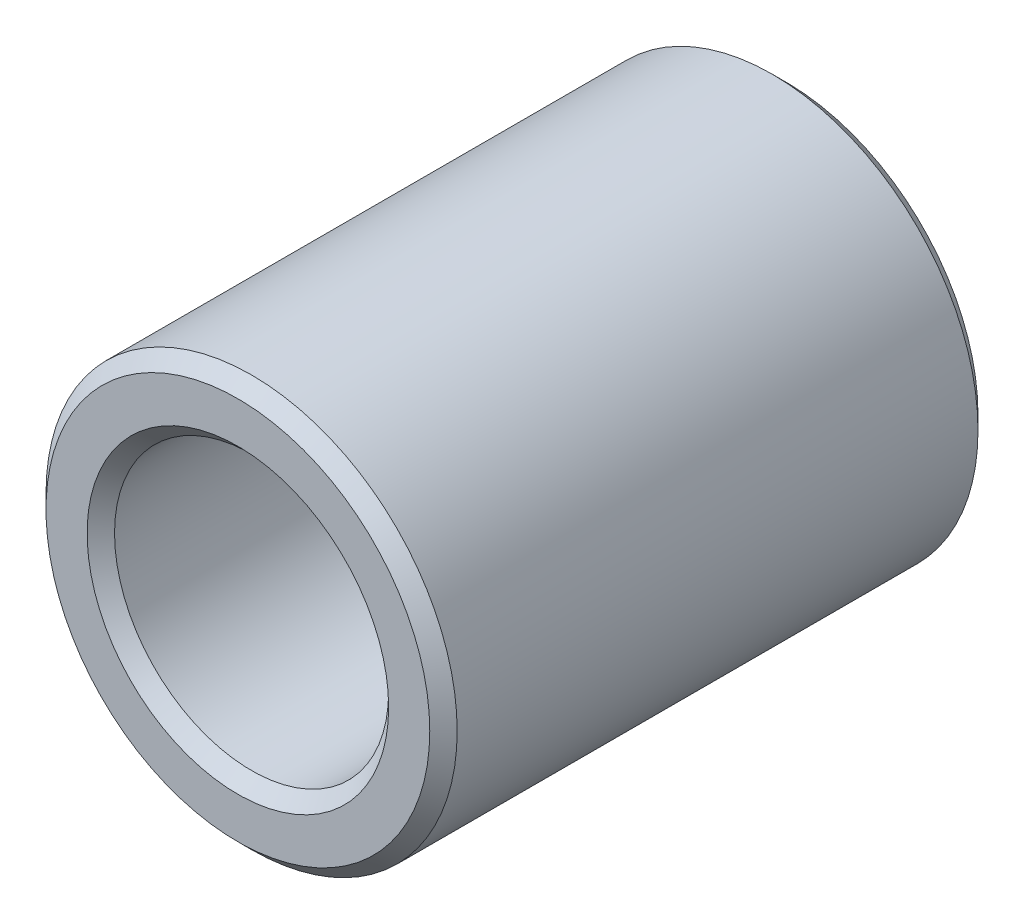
ISO-10303-21;
HEADER;
FILE_DESCRIPTION(('STEP AP214'),'2;1');
FILE_NAME('part.step','',(''),(''),'','','');
FILE_SCHEMA(('AUTOMOTIVE_DESIGN { 1 0 10303 214 1 1 1 1 }'));
ENDSEC;
DATA;
#1=APPLICATION_CONTEXT('core data for automotive mechanical design processes');
#2=APPLICATION_PROTOCOL_DEFINITION('international standard','automotive_design',2000,#1);
#3=PRODUCT_CONTEXT('',#1,'mechanical');
#4=PRODUCT('Part','Part','',(#3));
#5=PRODUCT_RELATED_PRODUCT_CATEGORY('part','',(#4));
#6=PRODUCT_DEFINITION_FORMATION('','',#4);
#7=PRODUCT_DEFINITION_CONTEXT('part definition',#1,'design');
#8=PRODUCT_DEFINITION('design','',#6,#7);
#9=PRODUCT_DEFINITION_SHAPE('','',#8);
#10=(LENGTH_UNIT() NAMED_UNIT(*) SI_UNIT(.MILLI.,.METRE.));
#11=(NAMED_UNIT(*) PLANE_ANGLE_UNIT() SI_UNIT($,.RADIAN.));
#12=(NAMED_UNIT(*) SI_UNIT($,.STERADIAN.) SOLID_ANGLE_UNIT());
#13=UNCERTAINTY_MEASURE_WITH_UNIT(LENGTH_MEASURE(1.E-05),#10,'distance_accuracy_value','');
#14=(GEOMETRIC_REPRESENTATION_CONTEXT(3) GLOBAL_UNCERTAINTY_ASSIGNED_CONTEXT((#13)) GLOBAL_UNIT_ASSIGNED_CONTEXT((#10,
#11,#12)) REPRESENTATION_CONTEXT('',''));
#15=CARTESIAN_POINT('',(0.,0.,0.));
#16=DIRECTION('',(0.,0.,1.));
#17=DIRECTION('',(1.,0.,0.));
#18=AXIS2_PLACEMENT_3D('',#15,#16,#17);
#19=CARTESIAN_POINT('',(0.,0.,80.));
#20=DIRECTION('',(0.,0.,1.));
#21=DIRECTION('',(1.,0.,0.));
#22=AXIS2_PLACEMENT_3D('',#19,#20,#21);
#23=PLANE('',#22);
#24=CARTESIAN_POINT('',(0.,0.,80.));
#25=DIRECTION('',(0.,0.,1.));
#26=DIRECTION('',(1.,0.,0.));
#27=AXIS2_PLACEMENT_3D('',#24,#25,#26);
#28=CIRCLE('',#27,44.);
#29=CARTESIAN_POINT('',(44.,0.,80.));
#30=VERTEX_POINT('',#29);
#31=EDGE_CURVE('E10',#30,#30,#28,.F.);
#32=ORIENTED_EDGE('',*,*,#31,.T.);
#33=EDGE_LOOP('',(#32));
#34=FACE_BOUND('',#33,.T.);
#35=CARTESIAN_POINT('',(0.,0.,80.));
#36=DIRECTION('',(0.,0.,1.));
#37=DIRECTION('',(1.,0.,0.));
#38=AXIS2_PLACEMENT_3D('',#35,#36,#37);
#39=CIRCLE('',#38,56.);
#40=CARTESIAN_POINT('',(56.,0.,80.));
#41=VERTEX_POINT('',#40);
#42=EDGE_CURVE('E45',#41,#41,#39,.T.);
#43=ORIENTED_EDGE('',*,*,#42,.T.);
#44=EDGE_LOOP('',(#43));
#45=FACE_BOUND('',#44,.T.);
#46=ADVANCED_FACE('F37',(#34,#45),#23,.T.);
#47=CARTESIAN_POINT('',(0.,0.,-80.));
#48=DIRECTION('',(0.,0.,1.));
#49=DIRECTION('',(1.,0.,0.));
#50=AXIS2_PLACEMENT_3D('',#47,#48,#49);
#51=PLANE('',#50);
#52=CARTESIAN_POINT('',(0.,0.,-80.));
#53=DIRECTION('',(0.,0.,1.));
#54=DIRECTION('',(1.,0.,0.));
#55=AXIS2_PLACEMENT_3D('',#52,#53,#54);
#56=CIRCLE('',#55,44.);
#57=CARTESIAN_POINT('',(44.,0.,-80.));
#58=VERTEX_POINT('',#57);
#59=EDGE_CURVE('E70',#58,#58,#56,.T.);
#60=ORIENTED_EDGE('',*,*,#59,.T.);
#61=EDGE_LOOP('',(#60));
#62=FACE_BOUND('',#61,.T.);
#63=CARTESIAN_POINT('',(0.,0.,-80.));
#64=DIRECTION('',(0.,0.,1.));
#65=DIRECTION('',(1.,0.,0.));
#66=AXIS2_PLACEMENT_3D('',#63,#64,#65);
#67=CIRCLE('',#66,56.);
#68=CARTESIAN_POINT('',(56.,0.,-80.));
#69=VERTEX_POINT('',#68);
#70=EDGE_CURVE('E73',#69,#69,#67,.F.);
#71=ORIENTED_EDGE('',*,*,#70,.T.);
#72=EDGE_LOOP('',(#71));
#73=FACE_BOUND('',#72,.T.);
#74=ADVANCED_FACE('F78',(#62,#73),#51,.F.);
#75=CARTESIAN_POINT('',(0.,0.,80.));
#76=DIRECTION('',(0.,0.,-1.));
#77=DIRECTION('',(-1.,0.,0.));
#78=AXIS2_PLACEMENT_3D('',#75,#76,#77);
#79=CYLINDRICAL_SURFACE('',#78,60.);
#80=CARTESIAN_POINT('',(0.,0.,-76.));
#81=DIRECTION('',(0.,0.,1.));
#82=DIRECTION('',(1.,0.,0.));
#83=AXIS2_PLACEMENT_3D('',#80,#81,#82);
#84=CIRCLE('',#83,60.);
#85=CARTESIAN_POINT('',(60.,0.,-76.));
#86=VERTEX_POINT('',#85);
#87=EDGE_CURVE('E52',#86,#86,#84,.T.);
#88=ORIENTED_EDGE('',*,*,#87,.T.);
#89=EDGE_LOOP('',(#88));
#90=FACE_BOUND('',#89,.T.);
#91=CARTESIAN_POINT('',(0.,0.,76.));
#92=DIRECTION('',(0.,0.,1.));
#93=DIRECTION('',(1.,0.,0.));
#94=AXIS2_PLACEMENT_3D('',#91,#92,#93);
#95=CIRCLE('',#94,60.);
#96=CARTESIAN_POINT('',(60.,0.,76.));
#97=VERTEX_POINT('',#96);
#98=EDGE_CURVE('E57',#97,#97,#95,.F.);
#99=ORIENTED_EDGE('',*,*,#98,.T.);
#100=EDGE_LOOP('',(#99));
#101=FACE_BOUND('',#100,.T.);
#102=ADVANCED_FACE('F88',(#90,#101),#79,.T.);
#103=CARTESIAN_POINT('',(0.,0.,80.));
#104=DIRECTION('',(0.,0.,-1.));
#105=DIRECTION('',(-1.,0.,0.));
#106=AXIS2_PLACEMENT_3D('',#103,#104,#105);
#107=CYLINDRICAL_SURFACE('',#106,40.);
#108=CARTESIAN_POINT('',(0.,0.,-76.));
#109=DIRECTION('',(0.,0.,1.));
#110=DIRECTION('',(1.,0.,0.));
#111=AXIS2_PLACEMENT_3D('',#108,#109,#110);
#112=CIRCLE('',#111,40.);
#113=CARTESIAN_POINT('',(40.,0.,-76.));
#114=VERTEX_POINT('',#113);
#115=EDGE_CURVE('E63',#114,#114,#112,.F.);
#116=ORIENTED_EDGE('',*,*,#115,.T.);
#117=EDGE_LOOP('',(#116));
#118=FACE_BOUND('',#117,.T.);
#119=CARTESIAN_POINT('',(0.,0.,76.0000000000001));
#120=DIRECTION('',(0.,0.,1.));
#121=DIRECTION('',(1.,0.,0.));
#122=AXIS2_PLACEMENT_3D('',#119,#120,#121);
#123=CIRCLE('',#122,40.);
#124=CARTESIAN_POINT('',(40.,0.,76.0000000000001));
#125=VERTEX_POINT('',#124);
#126=EDGE_CURVE('E66',#125,#125,#123,.T.);
#127=ORIENTED_EDGE('',*,*,#126,.T.);
#128=EDGE_LOOP('',(#127));
#129=FACE_BOUND('',#128,.T.);
#130=ADVANCED_FACE('F91',(#118,#129),#107,.F.);
#131=CARTESIAN_POINT('',(0.,0.,-80.));
#132=DIRECTION('',(0.,0.,-1.));
#133=DIRECTION('',(-1.,0.,0.));
#134=AXIS2_PLACEMENT_3D('',#131,#132,#133);
#135=CONICAL_SURFACE('',#134,44.,0.785398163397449);
#136=ORIENTED_EDGE('',*,*,#115,.F.);
#137=EDGE_LOOP('',(#136));
#138=FACE_BOUND('',#137,.T.);
#139=ORIENTED_EDGE('',*,*,#59,.F.);
#140=EDGE_LOOP('',(#139));
#141=FACE_BOUND('',#140,.T.);
#142=ADVANCED_FACE('F84',(#138,#141),#135,.F.);
#143=CARTESIAN_POINT('',(0.,0.,-76.));
#144=DIRECTION('',(0.,0.,1.));
#145=DIRECTION('',(1.,0.,0.));
#146=AXIS2_PLACEMENT_3D('',#143,#144,#145);
#147=CONICAL_SURFACE('',#146,60.,0.785398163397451);
#148=ORIENTED_EDGE('',*,*,#70,.F.);
#149=EDGE_LOOP('',(#148));
#150=FACE_BOUND('',#149,.T.);
#151=ORIENTED_EDGE('',*,*,#87,.F.);
#152=EDGE_LOOP('',(#151));
#153=FACE_BOUND('',#152,.T.);
#154=ADVANCED_FACE('F80',(#150,#153),#147,.T.);
#155=CARTESIAN_POINT('',(0.,0.,76.0000000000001));
#156=DIRECTION('',(0.,0.,1.));
#157=DIRECTION('',(1.,0.,0.));
#158=AXIS2_PLACEMENT_3D('',#155,#156,#157);
#159=CONICAL_SURFACE('',#158,40.,0.785398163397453);
#160=ORIENTED_EDGE('',*,*,#31,.F.);
#161=EDGE_LOOP('',(#160));
#162=FACE_BOUND('',#161,.T.);
#163=ORIENTED_EDGE('',*,*,#126,.F.);
#164=EDGE_LOOP('',(#163));
#165=FACE_BOUND('',#164,.T.);
#166=ADVANCED_FACE('F83',(#162,#165),#159,.F.);
#167=CARTESIAN_POINT('',(0.,0.,80.));
#168=DIRECTION('',(0.,0.,-1.));
#169=DIRECTION('',(-1.,0.,0.));
#170=AXIS2_PLACEMENT_3D('',#167,#168,#169);
#171=CONICAL_SURFACE('',#170,56.,0.785398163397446);
#172=ORIENTED_EDGE('',*,*,#98,.F.);
#173=EDGE_LOOP('',(#172));
#174=FACE_BOUND('',#173,.T.);
#175=ORIENTED_EDGE('',*,*,#42,.F.);
#176=EDGE_LOOP('',(#175));
#177=FACE_BOUND('',#176,.T.);
#178=ADVANCED_FACE('F39',(#174,#177),#171,.T.);
#179=CLOSED_SHELL('',(#46,#74,#102,#130,#142,#154,#166,#178));
#180=MANIFOLD_SOLID_BREP('B2',#179);
#181=ADVANCED_BREP_SHAPE_REPRESENTATION('',(#18,#180),#14);
#182=SHAPE_DEFINITION_REPRESENTATION(#9,#181);
ENDSEC;
END-ISO-10303-21;
